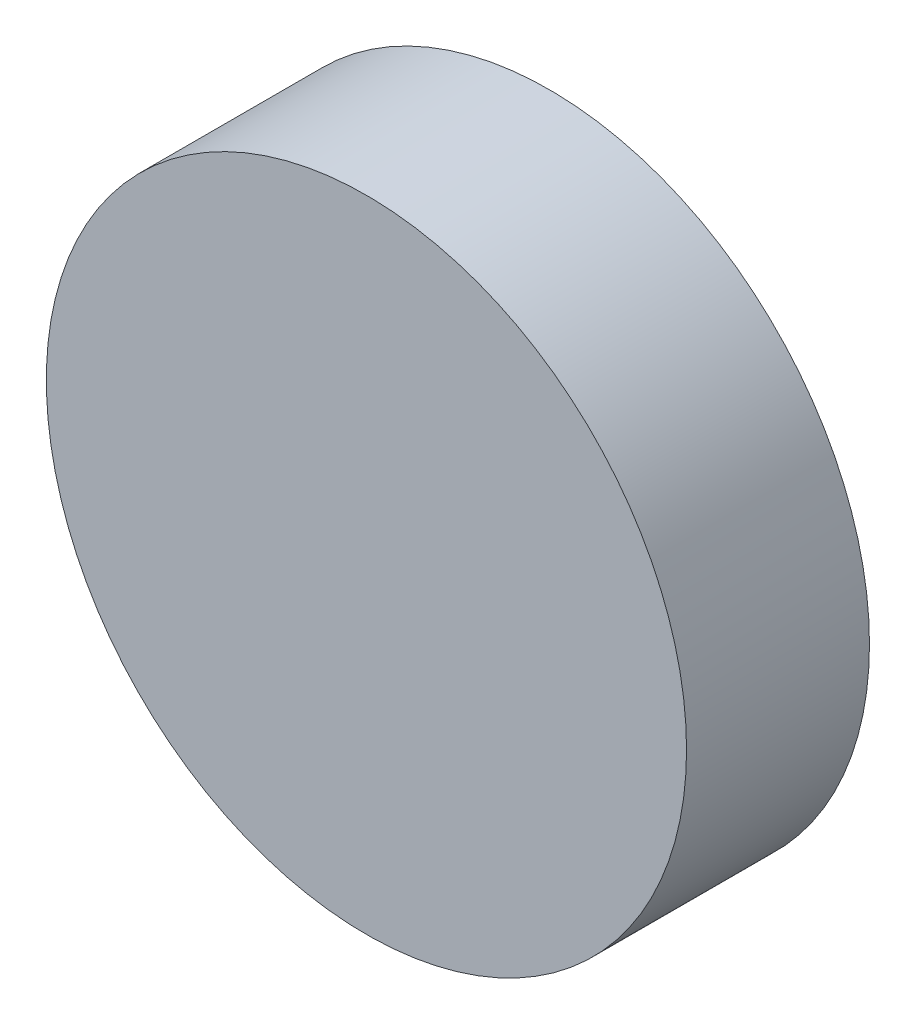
from build123d import *

# Parameters (mm, degrees)
AUFSATZ_LINEAR_START            = 30
SKIZZE2_R                       = 17.5
AUFSATZ_LINEAR_AUSTRAGEN1_DEPTH = 10


with BuildPart() as part:
    # Skizze2 → Aufsatz-Linear austragen1 (new body)
    with BuildSketch(Plane.XY.offset(AUFSATZ_LINEAR_START)):
        with Locations((0, 50)):
            Circle(SKIZZE2_R)
    extrude(amount=AUFSATZ_LINEAR_AUSTRAGEN1_DEPTH)


solid = part.part
